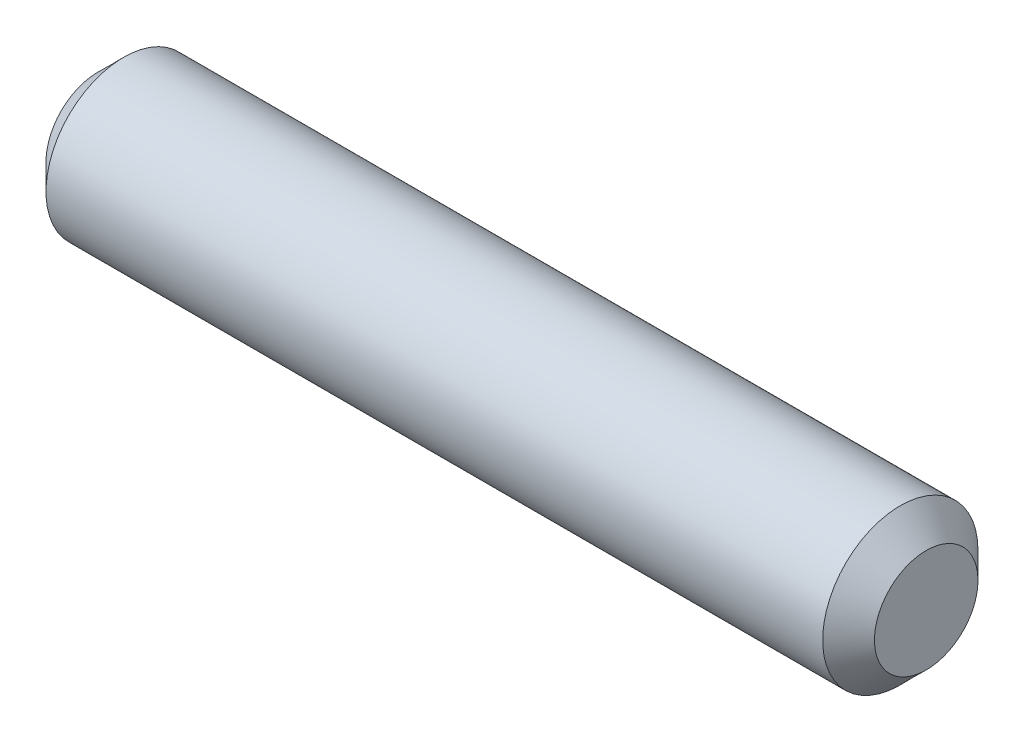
from build123d import *

# Parameters (mm, degrees)
SKETCH_8_R      = 1.5
EXTRUDE_5_DEPTH = 16
CHAMFER_2_SIZE  = 0.5


with BuildPart() as part:
    # Sketch 8 → Extrude 5 (new body)
    with BuildSketch(Plane(origin=(0, 0, 0), x_dir=(0, 0, -1), z_dir=(1, 0, 0))):
        Circle(SKETCH_8_R)
    extrude(amount=EXTRUDE_5_DEPTH)

    # Chamfer 2
    chamfer_2_edges = [part.edges().sort_by_distance(p)[0] for p in [
        (0, 0, 1.5),
        (16, 0, 1.5),
    ]]
    chamfer(chamfer_2_edges, length=CHAMFER_2_SIZE)


solid = part.part
